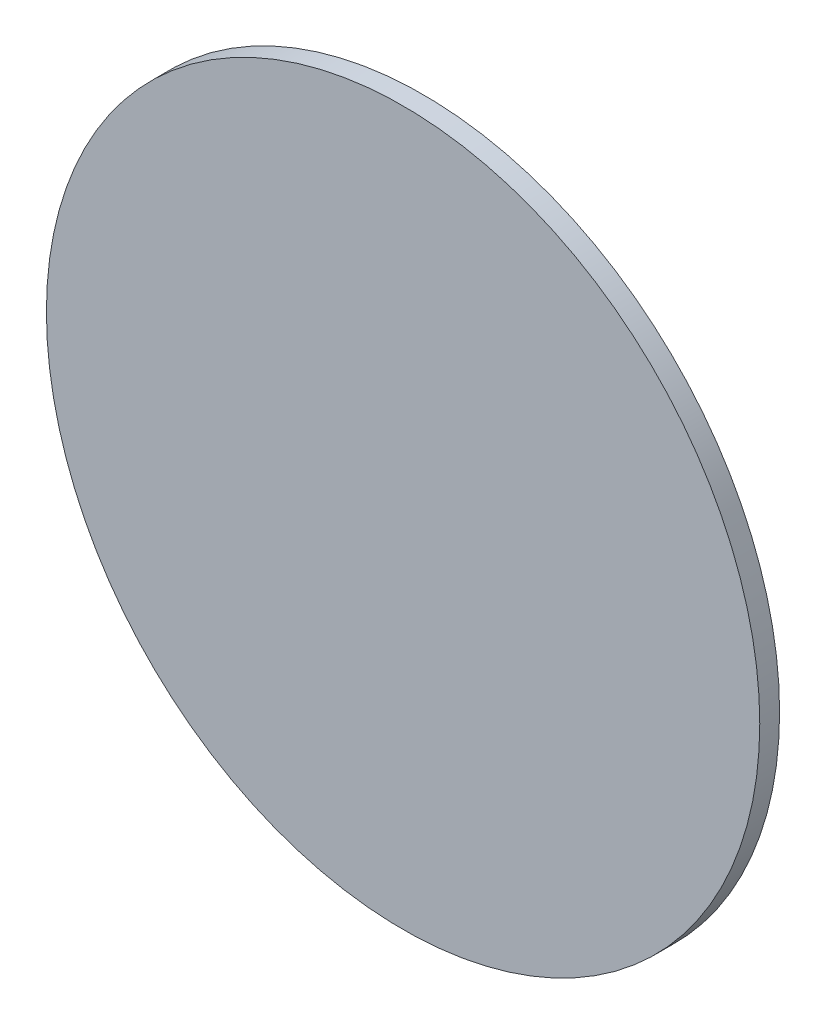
from build123d import *

# Parameters (mm, degrees)
ESQUISSE1_R        = 27
BOSS_EXTRU_1_DEPTH = 1.5


with BuildPart() as part:
    # Esquisse1 → Boss.-Extru.1 (new body)
    with BuildSketch(Plane.XY):
        Circle(ESQUISSE1_R)
    extrude(amount=BOSS_EXTRU_1_DEPTH)


solid = part.part
